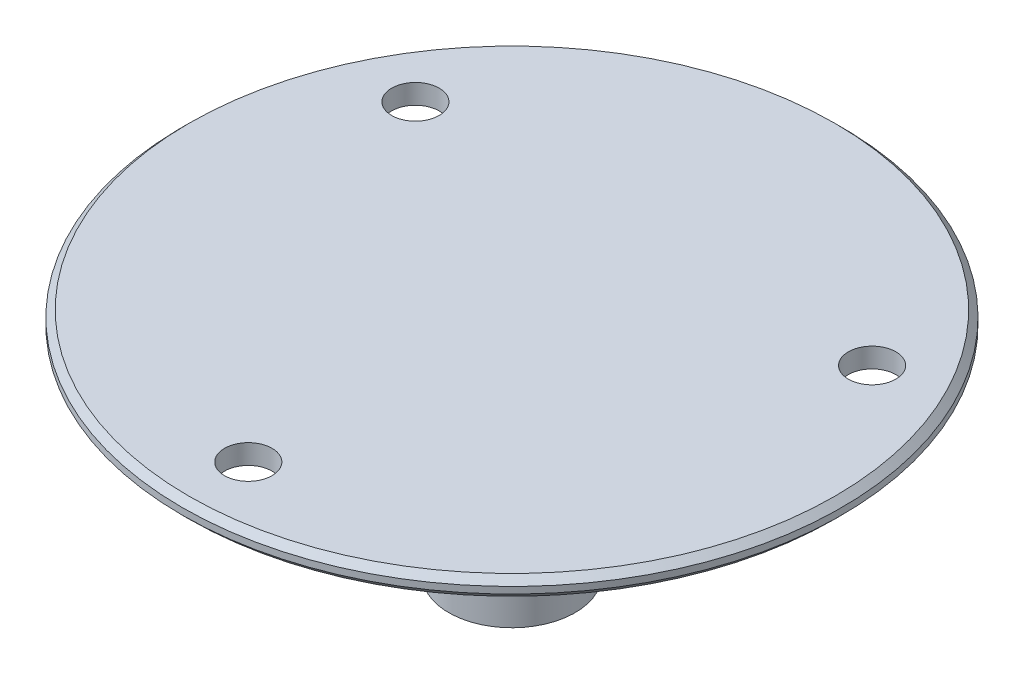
from build123d import *

# Parameters (mm, degrees)
SKETCH1_R               = 25
BOSS_EXTRUDE1_DEPTH     = 1.5
SKETCH2_R               = 4.8
SKETCH2_R_2             = 3.3
BOSS_EXTRUDE2_DEPTH     = 16
CUT_EXTRUDE1_REACH      = 40.807
SKETCH3_R               = 1.8
CUT_EXTRUDE2_DEPTH      = 39.807215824
CUT_EXTRUDE2_DEPTH_BACK = 39.807215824
CHAMFER1_SIZE           = 0.5
CHAMFER2_SIZE           = 0.5
CHAMFER3_SIZE           = 0.5


with BuildPart() as part:
    # Sketch1 → Boss-Extrude1 (new body)
    with BuildSketch(Plane(origin=(0, 0, 0), x_dir=(1, 0, 0), z_dir=(0, 1, 0))):
        with Locations(Location((0, 0, 0), (0, 0, 270))):
            Circle(SKETCH1_R)
    extrude(amount=BOSS_EXTRUDE1_DEPTH)

    # Sketch2 → Boss-Extrude2 (add)
    with BuildSketch(Plane.XZ):
        with Locations(Location((0, 0, 0), (0, 0, 270))):
            Circle(SKETCH2_R)
        with Locations(Location((0, 0, 0), (0, 0, 270))):
            Circle(SKETCH2_R_2, mode=Mode.SUBTRACT)
    extrude(amount=BOSS_EXTRUDE2_DEPTH)

    # Sketch3 → Cut-Extrude1 (cut, up to next)
    with BuildSketch(Plane.XZ, mode=Mode.PRIVATE) as cut_extrude1_sk1:
        with Locations(Location((0, 20, 0), (0, 0, 270))):
            Circle(SKETCH3_R)
    cut_extrude1_tool1 = extrude(cut_extrude1_sk1.sketch, amount=-CUT_EXTRUDE1_REACH, mode=Mode.PRIVATE) & part.part
    # Sketch3 → Cut-Extrude1 (cut, up to next)
    with BuildSketch(Plane.XZ, mode=Mode.PRIVATE) as cut_extrude1_sk2:
        with Locations(Location((17.320508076, -10, 0), (0, 0, 270))):
            Circle(SKETCH3_R)
    cut_extrude1_tool2 = extrude(cut_extrude1_sk2.sketch, amount=-CUT_EXTRUDE1_REACH, mode=Mode.PRIVATE) & part.part
    # Sketch3 → Cut-Extrude1 (cut, up to next)
    with BuildSketch(Plane.XZ, mode=Mode.PRIVATE) as cut_extrude1_sk3:
        with Locations(Location((-17.320508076, -10, 0), (0, 0, 270))):
            Circle(SKETCH3_R)
    cut_extrude1_tool3 = extrude(cut_extrude1_sk3.sketch, amount=-CUT_EXTRUDE1_REACH, mode=Mode.PRIVATE) & part.part
    add(cut_extrude1_tool1.solids().sort_by_distance((0, 0, 20))[0], mode=Mode.SUBTRACT)
    add(cut_extrude1_tool2.solids().sort_by_distance((17.320508, 0, -10))[0], mode=Mode.SUBTRACT)
    add(cut_extrude1_tool3.solids().sort_by_distance((-17.320508, 0, -10))[0], mode=Mode.SUBTRACT)

    # Sketch4 → Cut-Extrude2 (cut, two sides: drawn at the far end of the back side and taken through both)
    with BuildSketch(Plane.XY.offset(-CUT_EXTRUDE2_DEPTH_BACK)):
        with BuildLine():
            Line((0, -9), (-1.246460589, -10.344))
            ThreePointArc((-1.246460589, -10.344), (-1.7, -11.5), (-1.246460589, -12.656))
            Line((-1.246460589, -12.656), (0, -14))
            Line((0, -14), (1.246460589, -12.656))
            ThreePointArc((1.246460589, -12.656), (1.7, -11.5), (1.246460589, -10.344))
            Line((1.246460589, -10.344), (0, -9))
        make_face()
    extrude(amount=CUT_EXTRUDE2_DEPTH + CUT_EXTRUDE2_DEPTH_BACK, mode=Mode.SUBTRACT)

    # Chamfer1
    chamfer1_edges = [part.edges().sort_by_distance(p)[0] for p in [
        (0, -16, 3.3),
    ]]
    chamfer(chamfer1_edges, length=CHAMFER1_SIZE)

    # Chamfer2
    chamfer2_edges = [part.edges().sort_by_distance(p)[0] for p in [
        (0, 0, -25),
    ]]
    chamfer(chamfer2_edges, length=CHAMFER2_SIZE)

    # Chamfer3
    chamfer3_edges = [part.edges().sort_by_distance(p)[0] for p in [
        (0, 1.5, -25),
    ]]
    chamfer(chamfer3_edges, length=CHAMFER3_SIZE)


solid = part.part
